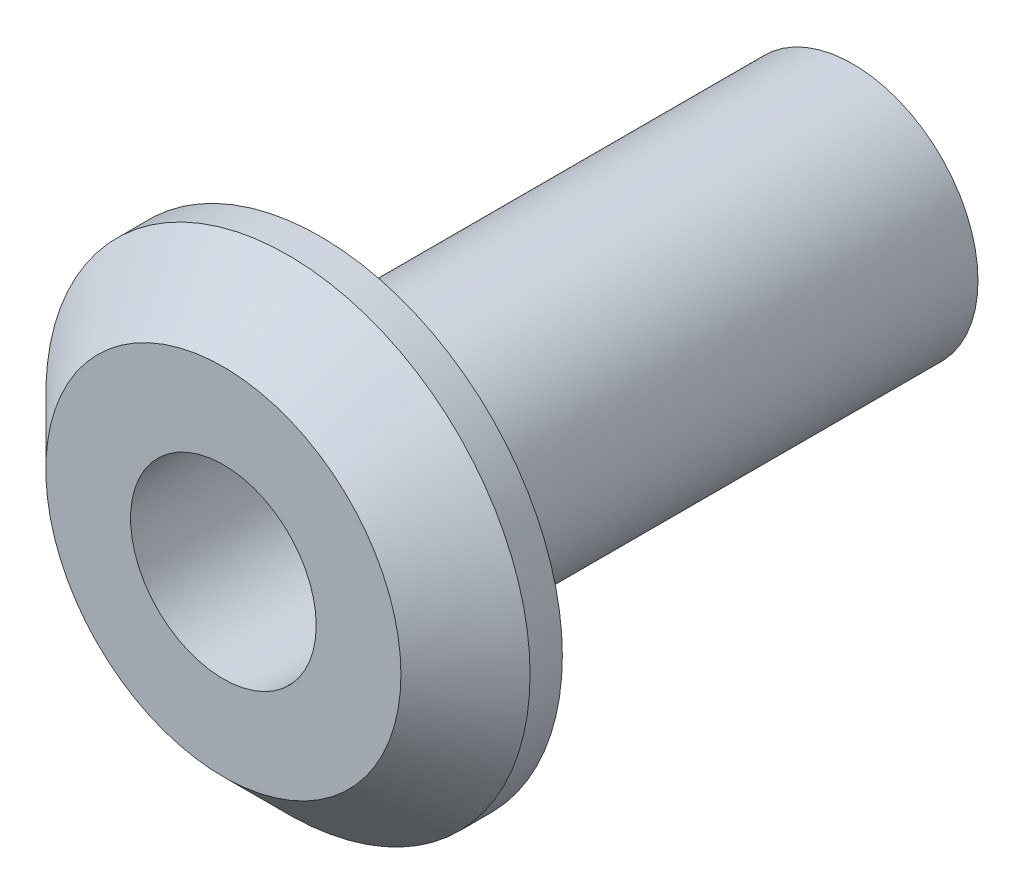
ISO-10303-21;
HEADER;
FILE_DESCRIPTION(('STEP AP214'),'2;1');
FILE_NAME('part.step','',(''),(''),'','','');
FILE_SCHEMA(('AUTOMOTIVE_DESIGN { 1 0 10303 214 1 1 1 1 }'));
ENDSEC;
DATA;
#1=APPLICATION_CONTEXT('core data for automotive mechanical design processes');
#2=APPLICATION_PROTOCOL_DEFINITION('international standard','automotive_design',2000,#1);
#3=PRODUCT_CONTEXT('',#1,'mechanical');
#4=PRODUCT('Part','Part','',(#3));
#5=PRODUCT_RELATED_PRODUCT_CATEGORY('part','',(#4));
#6=PRODUCT_DEFINITION_FORMATION('','',#4);
#7=PRODUCT_DEFINITION_CONTEXT('part definition',#1,'design');
#8=PRODUCT_DEFINITION('design','',#6,#7);
#9=PRODUCT_DEFINITION_SHAPE('','',#8);
#10=(LENGTH_UNIT() NAMED_UNIT(*) SI_UNIT(.MILLI.,.METRE.));
#11=(NAMED_UNIT(*) PLANE_ANGLE_UNIT() SI_UNIT($,.RADIAN.));
#12=(NAMED_UNIT(*) SI_UNIT($,.STERADIAN.) SOLID_ANGLE_UNIT());
#13=UNCERTAINTY_MEASURE_WITH_UNIT(LENGTH_MEASURE(1.E-05),#10,'distance_accuracy_value','');
#14=(GEOMETRIC_REPRESENTATION_CONTEXT(3) GLOBAL_UNCERTAINTY_ASSIGNED_CONTEXT((#13)) GLOBAL_UNIT_ASSIGNED_CONTEXT((#10,
#11,#12)) REPRESENTATION_CONTEXT('',''));
#15=CARTESIAN_POINT('',(0.,0.,0.));
#16=DIRECTION('',(0.,0.,1.));
#17=DIRECTION('',(1.,0.,0.));
#18=AXIS2_PLACEMENT_3D('',#15,#16,#17);
#19=CARTESIAN_POINT('',(0.,0.,1.5));
#20=DIRECTION('',(0.,0.,-1.));
#21=DIRECTION('',(-1.,0.,0.));
#22=AXIS2_PLACEMENT_3D('',#19,#20,#21);
#23=CYLINDRICAL_SURFACE('',#22,1.55);
#24=CARTESIAN_POINT('',(0.,0.,-18.));
#25=DIRECTION('',(0.,0.,-1.));
#26=DIRECTION('',(-1.,0.,0.));
#27=AXIS2_PLACEMENT_3D('',#24,#25,#26);
#28=CIRCLE('',#27,1.55);
#29=CARTESIAN_POINT('',(-1.55,0.,-18.));
#30=VERTEX_POINT('',#29);
#31=EDGE_CURVE('E61',#30,#30,#28,.T.);
#32=ORIENTED_EDGE('',*,*,#31,.T.);
#33=EDGE_LOOP('',(#32));
#34=FACE_BOUND('',#33,.T.);
#35=CARTESIAN_POINT('',(0.,0.,-6.));
#36=DIRECTION('',(0.,0.,1.));
#37=DIRECTION('',(1.,0.,0.));
#38=AXIS2_PLACEMENT_3D('',#35,#36,#37);
#39=CIRCLE('',#38,1.55);
#40=CARTESIAN_POINT('',(1.55,0.,-6.));
#41=VERTEX_POINT('',#40);
#42=EDGE_CURVE('E42',#41,#41,#39,.T.);
#43=ORIENTED_EDGE('',*,*,#42,.T.);
#44=EDGE_LOOP('',(#43));
#45=FACE_BOUND('',#44,.T.);
#46=ADVANCED_FACE('F37',(#34,#45),#23,.F.);
#47=CARTESIAN_POINT('',(0.,0.,-1.5));
#48=DIRECTION('',(0.,0.,1.));
#49=DIRECTION('',(1.,0.,0.));
#50=AXIS2_PLACEMENT_3D('',#47,#48,#49);
#51=PLANE('',#50);
#52=CARTESIAN_POINT('',(0.,0.,-1.5));
#53=DIRECTION('',(0.,0.,1.));
#54=DIRECTION('',(1.,0.,0.));
#55=AXIS2_PLACEMENT_3D('',#52,#53,#54);
#56=CIRCLE('',#55,7.5);
#57=CARTESIAN_POINT('',(7.5,0.,-1.5));
#58=VERTEX_POINT('',#57);
#59=EDGE_CURVE('E55',#58,#58,#56,.T.);
#60=ORIENTED_EDGE('',*,*,#59,.F.);
#61=EDGE_LOOP('',(#60));
#62=FACE_BOUND('',#61,.T.);
#63=CARTESIAN_POINT('',(0.,0.,-1.5));
#64=DIRECTION('',(0.,0.,1.));
#65=DIRECTION('',(1.,0.,0.));
#66=AXIS2_PLACEMENT_3D('',#63,#64,#65);
#67=CIRCLE('',#66,3.875);
#68=CARTESIAN_POINT('',(3.875,0.,-1.5));
#69=VERTEX_POINT('',#68);
#70=EDGE_CURVE('E10',#69,#69,#67,.F.);
#71=ORIENTED_EDGE('',*,*,#70,.F.);
#72=EDGE_LOOP('',(#71));
#73=FACE_BOUND('',#72,.T.);
#74=ADVANCED_FACE('F86',(#62,#73),#51,.F.);
#75=CARTESIAN_POINT('',(0.,0.,1.5));
#76=DIRECTION('',(0.,0.,1.));
#77=DIRECTION('',(1.,0.,0.));
#78=AXIS2_PLACEMENT_3D('',#75,#76,#77);
#79=PLANE('',#78);
#80=CARTESIAN_POINT('',(0.,0.,1.5));
#81=DIRECTION('',(0.,0.,1.));
#82=DIRECTION('',(1.,0.,0.));
#83=AXIS2_PLACEMENT_3D('',#80,#81,#82);
#84=CIRCLE('',#83,2.875);
#85=CARTESIAN_POINT('',(2.875,0.,1.5));
#86=VERTEX_POINT('',#85);
#87=EDGE_CURVE('E64',#86,#86,#84,.T.);
#88=ORIENTED_EDGE('',*,*,#87,.F.);
#89=EDGE_LOOP('',(#88));
#90=FACE_BOUND('',#89,.T.);
#91=CARTESIAN_POINT('',(0.,0.,1.5));
#92=DIRECTION('',(0.,0.,1.));
#93=DIRECTION('',(1.,0.,0.));
#94=AXIS2_PLACEMENT_3D('',#91,#92,#93);
#95=CIRCLE('',#94,5.5);
#96=CARTESIAN_POINT('',(5.5,0.,1.5));
#97=VERTEX_POINT('',#96);
#98=EDGE_CURVE('E50',#97,#97,#95,.T.);
#99=ORIENTED_EDGE('',*,*,#98,.T.);
#100=EDGE_LOOP('',(#99));
#101=FACE_BOUND('',#100,.T.);
#102=ADVANCED_FACE('F92',(#90,#101),#79,.T.);
#103=CARTESIAN_POINT('',(0.,0.,1.5));
#104=DIRECTION('',(0.,0.,-1.));
#105=DIRECTION('',(-1.,0.,0.));
#106=AXIS2_PLACEMENT_3D('',#103,#104,#105);
#107=CYLINDRICAL_SURFACE('',#106,7.5);
#108=CARTESIAN_POINT('',(0.,0.,-0.500000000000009));
#109=DIRECTION('',(0.,0.,1.));
#110=DIRECTION('',(1.,0.,0.));
#111=AXIS2_PLACEMENT_3D('',#108,#109,#110);
#112=CIRCLE('',#111,7.5);
#113=CARTESIAN_POINT('',(7.5,0.,-0.500000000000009));
#114=VERTEX_POINT('',#113);
#115=EDGE_CURVE('E46',#114,#114,#112,.F.);
#116=ORIENTED_EDGE('',*,*,#115,.T.);
#117=EDGE_LOOP('',(#116));
#118=FACE_BOUND('',#117,.T.);
#119=ORIENTED_EDGE('',*,*,#59,.T.);
#120=EDGE_LOOP('',(#119));
#121=FACE_BOUND('',#120,.T.);
#122=ADVANCED_FACE('F99',(#118,#121),#107,.T.);
#123=CARTESIAN_POINT('',(0.,0.,1.5));
#124=DIRECTION('',(0.,0.,-1.));
#125=DIRECTION('',(-1.,0.,0.));
#126=AXIS2_PLACEMENT_3D('',#123,#124,#125);
#127=CONICAL_SURFACE('',#126,5.5,0.785398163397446);
#128=ORIENTED_EDGE('',*,*,#115,.F.);
#129=EDGE_LOOP('',(#128));
#130=FACE_BOUND('',#129,.T.);
#131=ORIENTED_EDGE('',*,*,#98,.F.);
#132=EDGE_LOOP('',(#131));
#133=FACE_BOUND('',#132,.T.);
#134=ADVANCED_FACE('F40',(#130,#133),#127,.T.);
#135=CARTESIAN_POINT('',(0.,0.,-18.));
#136=DIRECTION('',(0.,0.,-1.));
#137=DIRECTION('',(-1.,0.,0.));
#138=AXIS2_PLACEMENT_3D('',#135,#136,#137);
#139=PLANE('',#138);
#140=CARTESIAN_POINT('',(0.,0.,-18.));
#141=DIRECTION('',(0.,0.,-1.));
#142=DIRECTION('',(-1.,0.,0.));
#143=AXIS2_PLACEMENT_3D('',#140,#141,#142);
#144=CIRCLE('',#143,3.875);
#145=CARTESIAN_POINT('',(-3.875,0.,-18.));
#146=VERTEX_POINT('',#145);
#147=EDGE_CURVE('E58',#146,#146,#144,.T.);
#148=ORIENTED_EDGE('',*,*,#147,.T.);
#149=EDGE_LOOP('',(#148));
#150=FACE_BOUND('',#149,.T.);
#151=ORIENTED_EDGE('',*,*,#31,.F.);
#152=EDGE_LOOP('',(#151));
#153=FACE_BOUND('',#152,.T.);
#154=ADVANCED_FACE('F106',(#150,#153),#139,.T.);
#155=CARTESIAN_POINT('',(0.,0.,-18.));
#156=DIRECTION('',(0.,0.,1.));
#157=DIRECTION('',(1.,0.,0.));
#158=AXIS2_PLACEMENT_3D('',#155,#156,#157);
#159=CYLINDRICAL_SURFACE('',#158,3.875);
#160=ORIENTED_EDGE('',*,*,#147,.F.);
#161=EDGE_LOOP('',(#160));
#162=FACE_BOUND('',#161,.T.);
#163=ORIENTED_EDGE('',*,*,#70,.T.);
#164=EDGE_LOOP('',(#163));
#165=FACE_BOUND('',#164,.T.);
#166=ADVANCED_FACE('F82',(#162,#165),#159,.T.);
#167=CARTESIAN_POINT('',(0.,0.,-6.));
#168=DIRECTION('',(0.,0.,1.));
#169=DIRECTION('',(1.,0.,0.));
#170=AXIS2_PLACEMENT_3D('',#167,#168,#169);
#171=CYLINDRICAL_SURFACE('',#170,2.875);
#172=CARTESIAN_POINT('',(0.,0.,-6.));
#173=DIRECTION('',(0.,0.,1.));
#174=DIRECTION('',(1.,0.,0.));
#175=AXIS2_PLACEMENT_3D('',#172,#173,#174);
#176=CIRCLE('',#175,2.875);
#177=CARTESIAN_POINT('',(2.875,0.,-6.));
#178=VERTEX_POINT('',#177);
#179=EDGE_CURVE('E67',#178,#178,#176,.T.);
#180=ORIENTED_EDGE('',*,*,#179,.F.);
#181=EDGE_LOOP('',(#180));
#182=FACE_BOUND('',#181,.T.);
#183=ORIENTED_EDGE('',*,*,#87,.T.);
#184=EDGE_LOOP('',(#183));
#185=FACE_BOUND('',#184,.T.);
#186=ADVANCED_FACE('F77',(#182,#185),#171,.F.);
#187=CARTESIAN_POINT('',(0.,0.,-6.));
#188=DIRECTION('',(0.,0.,1.));
#189=DIRECTION('',(1.,0.,0.));
#190=AXIS2_PLACEMENT_3D('',#187,#188,#189);
#191=PLANE('',#190);
#192=ORIENTED_EDGE('',*,*,#42,.F.);
#193=EDGE_LOOP('',(#192));
#194=FACE_BOUND('',#193,.T.);
#195=ORIENTED_EDGE('',*,*,#179,.T.);
#196=EDGE_LOOP('',(#195));
#197=FACE_BOUND('',#196,.T.);
#198=ADVANCED_FACE('F75',(#194,#197),#191,.T.);
#199=CLOSED_SHELL('',(#46,#74,#102,#122,#134,#154,#166,#186,#198));
#200=MANIFOLD_SOLID_BREP('B2',#199);
#201=ADVANCED_BREP_SHAPE_REPRESENTATION('',(#18,#200),#14);
#202=SHAPE_DEFINITION_REPRESENTATION(#9,#201);
ENDSEC;
END-ISO-10303-21;
